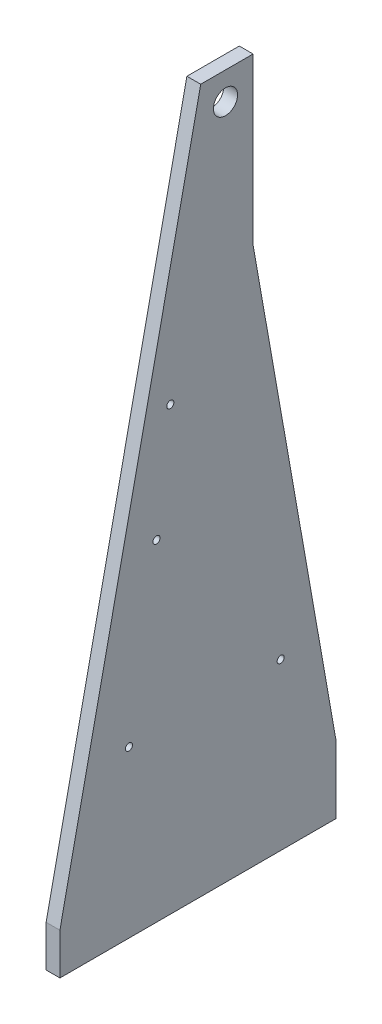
ISO-10303-21;
HEADER;
FILE_DESCRIPTION(('STEP AP214'),'2;1');
FILE_NAME('part.step','',(''),(''),'','','');
FILE_SCHEMA(('AUTOMOTIVE_DESIGN { 1 0 10303 214 1 1 1 1 }'));
ENDSEC;
DATA;
#1=APPLICATION_CONTEXT('core data for automotive mechanical design processes');
#2=APPLICATION_PROTOCOL_DEFINITION('international standard','automotive_design',2000,#1);
#3=PRODUCT_CONTEXT('',#1,'mechanical');
#4=PRODUCT('Part','Part','',(#3));
#5=PRODUCT_RELATED_PRODUCT_CATEGORY('part','',(#4));
#6=PRODUCT_DEFINITION_FORMATION('','',#4);
#7=PRODUCT_DEFINITION_CONTEXT('part definition',#1,'design');
#8=PRODUCT_DEFINITION('design','',#6,#7);
#9=PRODUCT_DEFINITION_SHAPE('','',#8);
#10=(LENGTH_UNIT() NAMED_UNIT(*) SI_UNIT(.MILLI.,.METRE.));
#11=(NAMED_UNIT(*) PLANE_ANGLE_UNIT() SI_UNIT($,.RADIAN.));
#12=(NAMED_UNIT(*) SI_UNIT($,.STERADIAN.) SOLID_ANGLE_UNIT());
#13=UNCERTAINTY_MEASURE_WITH_UNIT(LENGTH_MEASURE(1.E-05),#10,'distance_accuracy_value','');
#14=(GEOMETRIC_REPRESENTATION_CONTEXT(3) GLOBAL_UNCERTAINTY_ASSIGNED_CONTEXT((#13)) GLOBAL_UNIT_ASSIGNED_CONTEXT((#10,
#11,#12)) REPRESENTATION_CONTEXT('',''));
#15=CARTESIAN_POINT('',(0.,0.,0.));
#16=DIRECTION('',(0.,0.,1.));
#17=DIRECTION('',(1.,0.,0.));
#18=AXIS2_PLACEMENT_3D('',#15,#16,#17);
#19=CARTESIAN_POINT('',(12.7,38.1,127.));
#20=DIRECTION('',(0.,-0.20791169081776,-0.978147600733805));
#21=DIRECTION('',(0.,0.978147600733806,-0.20791169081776));
#22=AXIS2_PLACEMENT_3D('',#19,#20,#21);
#23=PLANE('',#22);
#24=DIRECTION('',(0.,-0.978147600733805,0.20791169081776));
#25=VECTOR('',#24,1.);
#26=CARTESIAN_POINT('',(0.,38.1,127.));
#27=LINE('',#26,#25);
#28=CARTESIAN_POINT('',(0.,647.7,-2.57447999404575));
#29=VERTEX_POINT('',#28);
#30=CARTESIAN_POINT('',(0.,38.1,127.));
#31=VERTEX_POINT('',#30);
#32=EDGE_CURVE('E176',#29,#31,#27,.T.);
#33=ORIENTED_EDGE('',*,*,#32,.T.);
#34=DIRECTION('',(-1.,0.,0.));
#35=VECTOR('',#34,1.);
#36=CARTESIAN_POINT('',(12.7,38.1,127.));
#37=LINE('',#36,#35);
#38=CARTESIAN_POINT('',(12.7,38.1,127.));
#39=VERTEX_POINT('',#38);
#40=EDGE_CURVE('E221',#39,#31,#37,.T.);
#41=ORIENTED_EDGE('',*,*,#40,.F.);
#42=DIRECTION('',(0.,-0.978147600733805,0.20791169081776));
#43=VECTOR('',#42,1.);
#44=CARTESIAN_POINT('',(12.7,38.1,127.));
#45=LINE('',#44,#43);
#46=CARTESIAN_POINT('',(12.7,647.7,-2.57447999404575));
#47=VERTEX_POINT('',#46);
#48=EDGE_CURVE('E177',#47,#39,#45,.T.);
#49=ORIENTED_EDGE('',*,*,#48,.F.);
#50=DIRECTION('',(-1.,0.,0.));
#51=VECTOR('',#50,1.);
#52=CARTESIAN_POINT('',(12.7,647.7,-2.57447999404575));
#53=LINE('',#52,#51);
#54=EDGE_CURVE('E193',#47,#29,#53,.T.);
#55=ORIENTED_EDGE('',*,*,#54,.T.);
#56=EDGE_LOOP('',(#33,#41,#49,#55));
#57=FACE_BOUND('',#56,.T.);
#58=ADVANCED_FACE('F37',(#57),#23,.F.);
#59=CARTESIAN_POINT('',(12.7,0.,127.));
#60=DIRECTION('',(0.,0.,-1.));
#61=DIRECTION('',(-1.,0.,0.));
#62=AXIS2_PLACEMENT_3D('',#59,#60,#61);
#63=PLANE('',#62);
#64=DIRECTION('',(0.,-1.,0.));
#65=VECTOR('',#64,1.);
#66=CARTESIAN_POINT('',(0.,0.,127.));
#67=LINE('',#66,#65);
#68=CARTESIAN_POINT('',(0.,0.,127.));
#69=VERTEX_POINT('',#68);
#70=EDGE_CURVE('E196',#31,#69,#67,.T.);
#71=ORIENTED_EDGE('',*,*,#70,.T.);
#72=DIRECTION('',(-1.,0.,0.));
#73=VECTOR('',#72,1.);
#74=CARTESIAN_POINT('',(12.7,0.,127.));
#75=LINE('',#74,#73);
#76=CARTESIAN_POINT('',(12.7,0.,127.));
#77=VERTEX_POINT('',#76);
#78=EDGE_CURVE('E218',#77,#69,#75,.T.);
#79=ORIENTED_EDGE('',*,*,#78,.F.);
#80=DIRECTION('',(0.,-1.,0.));
#81=VECTOR('',#80,1.);
#82=CARTESIAN_POINT('',(12.7,0.,127.));
#83=LINE('',#82,#81);
#84=EDGE_CURVE('E180',#39,#77,#83,.T.);
#85=ORIENTED_EDGE('',*,*,#84,.F.);
#86=ORIENTED_EDGE('',*,*,#40,.T.);
#87=EDGE_LOOP('',(#71,#79,#85,#86));
#88=FACE_BOUND('',#87,.T.);
#89=ADVANCED_FACE('F261',(#88),#63,.F.);
#90=CARTESIAN_POINT('',(12.7,0.,-127.));
#91=DIRECTION('',(0.,1.,0.));
#92=DIRECTION('',(0.,0.,1.));
#93=AXIS2_PLACEMENT_3D('',#90,#91,#92);
#94=PLANE('',#93);
#95=CARTESIAN_POINT('',(6.35,0.,-101.6));
#96=DIRECTION('',(0.,-1.,0.));
#97=DIRECTION('',(0.,0.,-1.));
#98=AXIS2_PLACEMENT_3D('',#95,#96,#97);
#99=CIRCLE('',#98,2.55269999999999);
#100=CARTESIAN_POINT('',(6.35,0.,-104.1527));
#101=VERTEX_POINT('',#100);
#102=EDGE_CURVE('E126',#101,#101,#99,.T.);
#103=ORIENTED_EDGE('',*,*,#102,.F.);
#104=EDGE_LOOP('',(#103));
#105=FACE_BOUND('',#104,.T.);
#106=CARTESIAN_POINT('',(6.34999999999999,0.,-50.8));
#107=DIRECTION('',(0.,-1.,0.));
#108=DIRECTION('',(0.,0.,-1.));
#109=AXIS2_PLACEMENT_3D('',#106,#107,#108);
#110=CIRCLE('',#109,2.55269999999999);
#111=CARTESIAN_POINT('',(6.34999999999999,0.,-53.3527));
#112=VERTEX_POINT('',#111);
#113=EDGE_CURVE('E125',#112,#112,#110,.T.);
#114=ORIENTED_EDGE('',*,*,#113,.F.);
#115=EDGE_LOOP('',(#114));
#116=FACE_BOUND('',#115,.T.);
#117=CARTESIAN_POINT('',(6.34999999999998,0.,0.));
#118=DIRECTION('',(0.,-1.,0.));
#119=DIRECTION('',(0.,0.,-1.));
#120=AXIS2_PLACEMENT_3D('',#117,#118,#119);
#121=CIRCLE('',#120,2.55269999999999);
#122=CARTESIAN_POINT('',(6.34999999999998,0.,-2.55269999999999));
#123=VERTEX_POINT('',#122);
#124=EDGE_CURVE('E136',#123,#123,#121,.T.);
#125=ORIENTED_EDGE('',*,*,#124,.F.);
#126=EDGE_LOOP('',(#125));
#127=FACE_BOUND('',#126,.T.);
#128=CARTESIAN_POINT('',(6.34999999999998,0.,50.8));
#129=DIRECTION('',(0.,-1.,0.));
#130=DIRECTION('',(0.,0.,-1.));
#131=AXIS2_PLACEMENT_3D('',#128,#129,#130);
#132=CIRCLE('',#131,2.55269999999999);
#133=CARTESIAN_POINT('',(6.34999999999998,0.,48.2473));
#134=VERTEX_POINT('',#133);
#135=EDGE_CURVE('E142',#134,#134,#132,.T.);
#136=ORIENTED_EDGE('',*,*,#135,.F.);
#137=EDGE_LOOP('',(#136));
#138=FACE_BOUND('',#137,.T.);
#139=CARTESIAN_POINT('',(6.34999999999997,0.,101.6));
#140=DIRECTION('',(0.,-1.,0.));
#141=DIRECTION('',(0.,0.,-1.));
#142=AXIS2_PLACEMENT_3D('',#139,#140,#141);
#143=CIRCLE('',#142,2.55269999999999);
#144=CARTESIAN_POINT('',(6.34999999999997,0.,99.0473));
#145=VERTEX_POINT('',#144);
#146=EDGE_CURVE('E148',#145,#145,#143,.T.);
#147=ORIENTED_EDGE('',*,*,#146,.F.);
#148=EDGE_LOOP('',(#147));
#149=FACE_BOUND('',#148,.T.);
#150=DIRECTION('',(0.,0.,-1.));
#151=VECTOR('',#150,1.);
#152=CARTESIAN_POINT('',(0.,0.,-127.));
#153=LINE('',#152,#151);
#154=CARTESIAN_POINT('',(0.,0.,-127.));
#155=VERTEX_POINT('',#154);
#156=EDGE_CURVE('E198',#69,#155,#153,.T.);
#157=ORIENTED_EDGE('',*,*,#156,.T.);
#158=DIRECTION('',(-1.,0.,0.));
#159=VECTOR('',#158,1.);
#160=CARTESIAN_POINT('',(12.7,0.,-127.));
#161=LINE('',#160,#159);
#162=CARTESIAN_POINT('',(12.7,0.,-127.));
#163=VERTEX_POINT('',#162);
#164=EDGE_CURVE('E215',#163,#155,#161,.T.);
#165=ORIENTED_EDGE('',*,*,#164,.F.);
#166=DIRECTION('',(0.,0.,-1.));
#167=VECTOR('',#166,1.);
#168=CARTESIAN_POINT('',(12.7,0.,-127.));
#169=LINE('',#168,#167);
#170=EDGE_CURVE('E183',#77,#163,#169,.T.);
#171=ORIENTED_EDGE('',*,*,#170,.F.);
#172=ORIENTED_EDGE('',*,*,#78,.T.);
#173=EDGE_LOOP('',(#157,#165,#171,#172));
#174=FACE_BOUND('',#173,.T.);
#175=ADVANCED_FACE('F265',(#105,#116,#127,#138,#149,#174),#94,.F.);
#176=CARTESIAN_POINT('',(12.7,63.1483253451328,-127.));
#177=DIRECTION('',(0.,0.,1.));
#178=DIRECTION('',(1.,0.,0.));
#179=AXIS2_PLACEMENT_3D('',#176,#177,#178);
#180=PLANE('',#179);
#181=DIRECTION('',(0.,1.,0.));
#182=VECTOR('',#181,1.);
#183=CARTESIAN_POINT('',(0.,63.1483253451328,-127.));
#184=LINE('',#183,#182);
#185=CARTESIAN_POINT('',(0.,63.1483253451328,-127.));
#186=VERTEX_POINT('',#185);
#187=EDGE_CURVE('E200',#155,#186,#184,.T.);
#188=ORIENTED_EDGE('',*,*,#187,.T.);
#189=DIRECTION('',(-1.,0.,0.));
#190=VECTOR('',#189,1.);
#191=CARTESIAN_POINT('',(12.7,63.1483253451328,-127.));
#192=LINE('',#191,#190);
#193=CARTESIAN_POINT('',(12.7,63.1483253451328,-127.));
#194=VERTEX_POINT('',#193);
#195=EDGE_CURVE('E212',#194,#186,#192,.T.);
#196=ORIENTED_EDGE('',*,*,#195,.F.);
#197=DIRECTION('',(0.,1.,0.));
#198=VECTOR('',#197,1.);
#199=CARTESIAN_POINT('',(12.7,63.1483253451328,-127.));
#200=LINE('',#199,#198);
#201=EDGE_CURVE('E185',#163,#194,#200,.T.);
#202=ORIENTED_EDGE('',*,*,#201,.F.);
#203=ORIENTED_EDGE('',*,*,#164,.T.);
#204=EDGE_LOOP('',(#188,#196,#202,#203));
#205=FACE_BOUND('',#204,.T.);
#206=ADVANCED_FACE('F271',(#205),#180,.F.);
#207=CARTESIAN_POINT('',(12.7,495.3,-50.7999999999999));
#208=DIRECTION('',(0.,-0.173648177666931,0.984807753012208));
#209=DIRECTION('',(0.,-0.984807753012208,-0.173648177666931));
#210=AXIS2_PLACEMENT_3D('',#207,#208,#209);
#211=PLANE('',#210);
#212=DIRECTION('',(0.,0.984807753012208,0.173648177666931));
#213=VECTOR('',#212,1.);
#214=CARTESIAN_POINT('',(0.,495.3,-50.7999999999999));
#215=LINE('',#214,#213);
#216=CARTESIAN_POINT('',(0.,494.468388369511,-50.9466355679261));
#217=VERTEX_POINT('',#216);
#218=EDGE_CURVE('E202',#186,#217,#215,.T.);
#219=ORIENTED_EDGE('',*,*,#218,.T.);
#220=DIRECTION('',(-1.,0.,0.));
#221=VECTOR('',#220,1.);
#222=CARTESIAN_POINT('',(12.7,494.468388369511,-50.9466355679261));
#223=LINE('',#222,#221);
#224=CARTESIAN_POINT('',(12.7,494.468388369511,-50.9466355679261));
#225=VERTEX_POINT('',#224);
#226=EDGE_CURVE('E52',#217,#225,#223,.F.);
#227=ORIENTED_EDGE('',*,*,#226,.T.);
#228=DIRECTION('',(0.,0.984807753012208,0.173648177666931));
#229=VECTOR('',#228,1.);
#230=CARTESIAN_POINT('',(12.7,495.3,-50.7999999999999));
#231=LINE('',#230,#229);
#232=EDGE_CURVE('E187',#194,#225,#231,.T.);
#233=ORIENTED_EDGE('',*,*,#232,.F.);
#234=ORIENTED_EDGE('',*,*,#195,.T.);
#235=EDGE_LOOP('',(#219,#227,#233,#234));
#236=FACE_BOUND('',#235,.T.);
#237=ADVANCED_FACE('F275',(#236),#211,.F.);
#238=CARTESIAN_POINT('',(12.7,647.7,-50.7999999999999));
#239=DIRECTION('',(0.,0.,1.));
#240=DIRECTION('',(0.,-1.,0.));
#241=AXIS2_PLACEMENT_3D('',#238,#239,#240);
#242=PLANE('',#241);
#243=DIRECTION('',(0.,1.,0.));
#244=VECTOR('',#243,1.);
#245=CARTESIAN_POINT('',(12.7,647.7,-50.7999999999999));
#246=LINE('',#245,#244);
#247=CARTESIAN_POINT('',(12.7,496.144440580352,-50.7999999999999));
#248=VERTEX_POINT('',#247);
#249=CARTESIAN_POINT('',(12.7,647.7,-50.7999999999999));
#250=VERTEX_POINT('',#249);
#251=EDGE_CURVE('E189',#248,#250,#246,.T.);
#252=ORIENTED_EDGE('',*,*,#251,.F.);
#253=DIRECTION('',(-1.,0.,0.));
#254=VECTOR('',#253,1.);
#255=CARTESIAN_POINT('',(0.,496.144440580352,-50.7999999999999));
#256=LINE('',#255,#254);
#257=CARTESIAN_POINT('',(0.,496.144440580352,-50.7999999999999));
#258=VERTEX_POINT('',#257);
#259=EDGE_CURVE('E224',#248,#258,#256,.T.);
#260=ORIENTED_EDGE('',*,*,#259,.T.);
#261=DIRECTION('',(0.,1.,0.));
#262=VECTOR('',#261,1.);
#263=CARTESIAN_POINT('',(0.,647.7,-50.7999999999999));
#264=LINE('',#263,#262);
#265=CARTESIAN_POINT('',(0.,647.7,-50.7999999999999));
#266=VERTEX_POINT('',#265);
#267=EDGE_CURVE('E204',#258,#266,#264,.T.);
#268=ORIENTED_EDGE('',*,*,#267,.T.);
#269=DIRECTION('',(-1.,0.,0.));
#270=VECTOR('',#269,1.);
#271=CARTESIAN_POINT('',(12.7,647.7,-50.7999999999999));
#272=LINE('',#271,#270);
#273=EDGE_CURVE('E209',#250,#266,#272,.T.);
#274=ORIENTED_EDGE('',*,*,#273,.F.);
#275=EDGE_LOOP('',(#252,#260,#268,#274));
#276=FACE_BOUND('',#275,.T.);
#277=ADVANCED_FACE('F238',(#276),#242,.F.);
#278=CARTESIAN_POINT('',(12.7,647.7,-2.57447999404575));
#279=DIRECTION('',(0.,-1.,0.));
#280=DIRECTION('',(0.,0.,-1.));
#281=AXIS2_PLACEMENT_3D('',#278,#279,#280);
#282=PLANE('',#281);
#283=DIRECTION('',(0.,0.,1.));
#284=VECTOR('',#283,1.);
#285=CARTESIAN_POINT('',(0.,647.7,-2.57447999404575));
#286=LINE('',#285,#284);
#287=EDGE_CURVE('E181',#266,#29,#286,.T.);
#288=ORIENTED_EDGE('',*,*,#287,.T.);
#289=ORIENTED_EDGE('',*,*,#54,.F.);
#290=DIRECTION('',(0.,0.,1.));
#291=VECTOR('',#290,1.);
#292=CARTESIAN_POINT('',(12.7,647.7,-2.57447999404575));
#293=LINE('',#292,#291);
#294=EDGE_CURVE('E191',#250,#47,#293,.T.);
#295=ORIENTED_EDGE('',*,*,#294,.F.);
#296=ORIENTED_EDGE('',*,*,#273,.T.);
#297=EDGE_LOOP('',(#288,#289,#295,#296));
#298=FACE_BOUND('',#297,.T.);
#299=ADVANCED_FACE('F247',(#298),#282,.F.);
#300=CARTESIAN_POINT('',(12.7,0.,0.));
#301=DIRECTION('',(-1.,0.,0.));
#302=DIRECTION('',(0.,0.,1.));
#303=AXIS2_PLACEMENT_3D('',#300,#301,#302);
#304=PLANE('',#303);
#305=CARTESIAN_POINT('',(12.7,406.4,25.4));
#306=DIRECTION('',(1.,0.,0.));
#307=DIRECTION('',(0.,0.,-1.));
#308=AXIS2_PLACEMENT_3D('',#305,#306,#307);
#309=CIRCLE('',#308,3.26389999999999);
#310=CARTESIAN_POINT('',(12.7,406.4,22.1361));
#311=VERTEX_POINT('',#310);
#312=EDGE_CURVE('E154',#311,#311,#309,.T.);
#313=ORIENTED_EDGE('',*,*,#312,.F.);
#314=EDGE_LOOP('',(#313));
#315=FACE_BOUND('',#314,.T.);
#316=CARTESIAN_POINT('',(12.7,304.8,38.1));
#317=DIRECTION('',(1.,0.,0.));
#318=DIRECTION('',(0.,0.,-1.));
#319=AXIS2_PLACEMENT_3D('',#316,#317,#318);
#320=CIRCLE('',#319,3.26389999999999);
#321=CARTESIAN_POINT('',(12.7,304.8,34.8361));
#322=VERTEX_POINT('',#321);
#323=EDGE_CURVE('E158',#322,#322,#320,.T.);
#324=ORIENTED_EDGE('',*,*,#323,.F.);
#325=EDGE_LOOP('',(#324));
#326=FACE_BOUND('',#325,.T.);
#327=CARTESIAN_POINT('',(12.7,152.4,63.5));
#328=DIRECTION('',(1.,0.,0.));
#329=DIRECTION('',(0.,0.,-1.));
#330=AXIS2_PLACEMENT_3D('',#327,#328,#329);
#331=CIRCLE('',#330,3.26389999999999);
#332=CARTESIAN_POINT('',(12.7,152.4,60.2361));
#333=VERTEX_POINT('',#332);
#334=EDGE_CURVE('E162',#333,#333,#331,.T.);
#335=ORIENTED_EDGE('',*,*,#334,.F.);
#336=EDGE_LOOP('',(#335));
#337=FACE_BOUND('',#336,.T.);
#338=CARTESIAN_POINT('',(12.7,152.4,-76.2));
#339=DIRECTION('',(1.,0.,0.));
#340=DIRECTION('',(0.,0.,-1.));
#341=AXIS2_PLACEMENT_3D('',#338,#339,#340);
#342=CIRCLE('',#341,3.26389999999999);
#343=CARTESIAN_POINT('',(12.7,152.4,-79.4639));
#344=VERTEX_POINT('',#343);
#345=EDGE_CURVE('E166',#344,#344,#342,.T.);
#346=ORIENTED_EDGE('',*,*,#345,.F.);
#347=EDGE_LOOP('',(#346));
#348=FACE_BOUND('',#347,.T.);
#349=CARTESIAN_POINT('',(12.7,622.3,-25.3999999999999));
#350=DIRECTION('',(1.,0.,0.));
#351=DIRECTION('',(0.,0.,-1.));
#352=AXIS2_PLACEMENT_3D('',#349,#350,#351);
#353=CIRCLE('',#352,11.1125);
#354=CARTESIAN_POINT('',(12.7,622.3,-36.5124999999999));
#355=VERTEX_POINT('',#354);
#356=EDGE_CURVE('E170',#355,#355,#353,.T.);
#357=ORIENTED_EDGE('',*,*,#356,.F.);
#358=EDGE_LOOP('',(#357));
#359=FACE_BOUND('',#358,.T.);
#360=ORIENTED_EDGE('',*,*,#48,.T.);
#361=ORIENTED_EDGE('',*,*,#84,.T.);
#362=ORIENTED_EDGE('',*,*,#170,.T.);
#363=ORIENTED_EDGE('',*,*,#201,.T.);
#364=ORIENTED_EDGE('',*,*,#232,.T.);
#365=CARTESIAN_POINT('',(12.7,496.144440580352,-60.4519999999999));
#366=DIRECTION('',(-1.,0.,0.));
#367=DIRECTION('',(0.,0.,1.));
#368=AXIS2_PLACEMENT_3D('',#365,#366,#367);
#369=CIRCLE('',#368,9.652);
#370=EDGE_CURVE('E11',#225,#248,#369,.T.);
#371=ORIENTED_EDGE('',*,*,#370,.T.);
#372=ORIENTED_EDGE('',*,*,#251,.T.);
#373=ORIENTED_EDGE('',*,*,#294,.T.);
#374=EDGE_LOOP('',(#360,#361,#362,#363,#364,#371,#372,#373));
#375=FACE_BOUND('',#374,.T.);
#376=ADVANCED_FACE('F253',(#315,#326,#337,#348,#359,#375),#304,.F.);
#377=CARTESIAN_POINT('',(0.,0.,0.));
#378=DIRECTION('',(-1.,0.,0.));
#379=DIRECTION('',(0.,0.,1.));
#380=AXIS2_PLACEMENT_3D('',#377,#378,#379);
#381=PLANE('',#380);
#382=CARTESIAN_POINT('',(0.,406.4,25.4));
#383=DIRECTION('',(-1.,0.,0.));
#384=DIRECTION('',(0.,0.,1.));
#385=AXIS2_PLACEMENT_3D('',#382,#383,#384);
#386=CIRCLE('',#385,3.26389999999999);
#387=CARTESIAN_POINT('',(0.,406.4,28.6639));
#388=VERTEX_POINT('',#387);
#389=EDGE_CURVE('E157',#388,#388,#386,.T.);
#390=ORIENTED_EDGE('',*,*,#389,.F.);
#391=EDGE_LOOP('',(#390));
#392=FACE_BOUND('',#391,.T.);
#393=CARTESIAN_POINT('',(0.,304.8,38.1));
#394=DIRECTION('',(-1.,0.,0.));
#395=DIRECTION('',(0.,0.,1.));
#396=AXIS2_PLACEMENT_3D('',#393,#394,#395);
#397=CIRCLE('',#396,3.26389999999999);
#398=CARTESIAN_POINT('',(0.,304.8,41.3639));
#399=VERTEX_POINT('',#398);
#400=EDGE_CURVE('E161',#399,#399,#397,.T.);
#401=ORIENTED_EDGE('',*,*,#400,.F.);
#402=EDGE_LOOP('',(#401));
#403=FACE_BOUND('',#402,.T.);
#404=CARTESIAN_POINT('',(0.,152.4,63.5));
#405=DIRECTION('',(-1.,0.,0.));
#406=DIRECTION('',(0.,0.,1.));
#407=AXIS2_PLACEMENT_3D('',#404,#405,#406);
#408=CIRCLE('',#407,3.26389999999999);
#409=CARTESIAN_POINT('',(0.,152.4,66.7639));
#410=VERTEX_POINT('',#409);
#411=EDGE_CURVE('E165',#410,#410,#408,.T.);
#412=ORIENTED_EDGE('',*,*,#411,.F.);
#413=EDGE_LOOP('',(#412));
#414=FACE_BOUND('',#413,.T.);
#415=CARTESIAN_POINT('',(0.,152.4,-76.2));
#416=DIRECTION('',(-1.,0.,0.));
#417=DIRECTION('',(0.,0.,1.));
#418=AXIS2_PLACEMENT_3D('',#415,#416,#417);
#419=CIRCLE('',#418,3.26389999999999);
#420=CARTESIAN_POINT('',(0.,152.4,-72.9361));
#421=VERTEX_POINT('',#420);
#422=EDGE_CURVE('E169',#421,#421,#419,.T.);
#423=ORIENTED_EDGE('',*,*,#422,.F.);
#424=EDGE_LOOP('',(#423));
#425=FACE_BOUND('',#424,.T.);
#426=CARTESIAN_POINT('',(0.,622.3,-25.3999999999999));
#427=DIRECTION('',(1.,0.,0.));
#428=DIRECTION('',(0.,0.,-1.));
#429=AXIS2_PLACEMENT_3D('',#426,#427,#428);
#430=CIRCLE('',#429,11.1125);
#431=CARTESIAN_POINT('',(0.,622.3,-36.5124999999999));
#432=VERTEX_POINT('',#431);
#433=EDGE_CURVE('E173',#432,#432,#430,.T.);
#434=ORIENTED_EDGE('',*,*,#433,.T.);
#435=EDGE_LOOP('',(#434));
#436=FACE_BOUND('',#435,.T.);
#437=ORIENTED_EDGE('',*,*,#32,.F.);
#438=ORIENTED_EDGE('',*,*,#287,.F.);
#439=ORIENTED_EDGE('',*,*,#267,.F.);
#440=CARTESIAN_POINT('',(0.,496.144440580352,-60.4519999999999));
#441=DIRECTION('',(-1.,0.,0.));
#442=DIRECTION('',(0.,0.,1.));
#443=AXIS2_PLACEMENT_3D('',#440,#441,#442);
#444=CIRCLE('',#443,9.652);
#445=EDGE_CURVE('E45',#258,#217,#444,.F.);
#446=ORIENTED_EDGE('',*,*,#445,.T.);
#447=ORIENTED_EDGE('',*,*,#218,.F.);
#448=ORIENTED_EDGE('',*,*,#187,.F.);
#449=ORIENTED_EDGE('',*,*,#156,.F.);
#450=ORIENTED_EDGE('',*,*,#70,.F.);
#451=EDGE_LOOP('',(#437,#438,#439,#446,#447,#448,#449,#450));
#452=FACE_BOUND('',#451,.T.);
#453=ADVANCED_FACE('F244',(#392,#403,#414,#425,#436,#452),#381,.T.);
#454=CARTESIAN_POINT('',(12.7,622.3,-25.3999999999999));
#455=DIRECTION('',(1.,0.,0.));
#456=DIRECTION('',(0.,0.,-1.));
#457=AXIS2_PLACEMENT_3D('',#454,#455,#456);
#458=CYLINDRICAL_SURFACE('',#457,11.1125);
#459=ORIENTED_EDGE('',*,*,#433,.F.);
#460=EDGE_LOOP('',(#459));
#461=FACE_BOUND('',#460,.T.);
#462=ORIENTED_EDGE('',*,*,#356,.T.);
#463=EDGE_LOOP('',(#462));
#464=FACE_BOUND('',#463,.T.);
#465=ADVANCED_FACE('F285',(#461,#464),#458,.F.);
#466=CARTESIAN_POINT('',(12.7,152.4,-76.2));
#467=DIRECTION('',(1.,0.,0.));
#468=DIRECTION('',(0.,0.,-1.));
#469=AXIS2_PLACEMENT_3D('',#466,#467,#468);
#470=CYLINDRICAL_SURFACE('',#469,3.26389999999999);
#471=ORIENTED_EDGE('',*,*,#422,.T.);
#472=EDGE_LOOP('',(#471));
#473=FACE_BOUND('',#472,.T.);
#474=ORIENTED_EDGE('',*,*,#345,.T.);
#475=EDGE_LOOP('',(#474));
#476=FACE_BOUND('',#475,.T.);
#477=ADVANCED_FACE('F292',(#473,#476),#470,.F.);
#478=CARTESIAN_POINT('',(12.7,152.4,63.5));
#479=DIRECTION('',(1.,0.,0.));
#480=DIRECTION('',(0.,0.,-1.));
#481=AXIS2_PLACEMENT_3D('',#478,#479,#480);
#482=CYLINDRICAL_SURFACE('',#481,3.26389999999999);
#483=ORIENTED_EDGE('',*,*,#411,.T.);
#484=EDGE_LOOP('',(#483));
#485=FACE_BOUND('',#484,.T.);
#486=ORIENTED_EDGE('',*,*,#334,.T.);
#487=EDGE_LOOP('',(#486));
#488=FACE_BOUND('',#487,.T.);
#489=ADVANCED_FACE('F296',(#485,#488),#482,.F.);
#490=CARTESIAN_POINT('',(12.7,304.8,38.1));
#491=DIRECTION('',(1.,0.,0.));
#492=DIRECTION('',(0.,0.,-1.));
#493=AXIS2_PLACEMENT_3D('',#490,#491,#492);
#494=CYLINDRICAL_SURFACE('',#493,3.26389999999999);
#495=ORIENTED_EDGE('',*,*,#400,.T.);
#496=EDGE_LOOP('',(#495));
#497=FACE_BOUND('',#496,.T.);
#498=ORIENTED_EDGE('',*,*,#323,.T.);
#499=EDGE_LOOP('',(#498));
#500=FACE_BOUND('',#499,.T.);
#501=ADVANCED_FACE('F300',(#497,#500),#494,.F.);
#502=CARTESIAN_POINT('',(12.7,406.4,25.4));
#503=DIRECTION('',(1.,0.,0.));
#504=DIRECTION('',(0.,0.,-1.));
#505=AXIS2_PLACEMENT_3D('',#502,#503,#504);
#506=CYLINDRICAL_SURFACE('',#505,3.26389999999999);
#507=ORIENTED_EDGE('',*,*,#389,.T.);
#508=EDGE_LOOP('',(#507));
#509=FACE_BOUND('',#508,.T.);
#510=ORIENTED_EDGE('',*,*,#312,.T.);
#511=EDGE_LOOP('',(#510));
#512=FACE_BOUND('',#511,.T.);
#513=ADVANCED_FACE('F304',(#509,#512),#506,.F.);
#514=CARTESIAN_POINT('',(6.34999999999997,13.335,101.6));
#515=DIRECTION('',(0.,-1.,0.));
#516=DIRECTION('',(0.,0.,-1.));
#517=AXIS2_PLACEMENT_3D('',#514,#515,#516);
#518=CONICAL_SURFACE('',#517,2.55269999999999,1.02974425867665);
#519=CARTESIAN_POINT('',(6.34999999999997,14.8688169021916,101.6));
#520=VERTEX_POINT('',#519);
#521=VERTEX_LOOP('',#520);
#522=FACE_BOUND('',#521,.T.);
#523=CARTESIAN_POINT('',(6.34999999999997,13.335,101.6));
#524=DIRECTION('',(0.,-1.,0.));
#525=DIRECTION('',(0.,0.,-1.));
#526=AXIS2_PLACEMENT_3D('',#523,#524,#525);
#527=CIRCLE('',#526,2.55269999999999);
#528=CARTESIAN_POINT('',(6.34999999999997,13.335,99.0473));
#529=VERTEX_POINT('',#528);
#530=EDGE_CURVE('E151',#529,#529,#527,.T.);
#531=ORIENTED_EDGE('',*,*,#530,.T.);
#532=EDGE_LOOP('',(#531));
#533=FACE_BOUND('',#532,.T.);
#534=ADVANCED_FACE('F308',(#522,#533),#518,.F.);
#535=CARTESIAN_POINT('',(6.34999999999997,0.,101.6));
#536=DIRECTION('',(0.,-1.,0.));
#537=DIRECTION('',(0.,0.,-1.));
#538=AXIS2_PLACEMENT_3D('',#535,#536,#537);
#539=CYLINDRICAL_SURFACE('',#538,2.55269999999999);
#540=ORIENTED_EDGE('',*,*,#530,.F.);
#541=EDGE_LOOP('',(#540));
#542=FACE_BOUND('',#541,.T.);
#543=ORIENTED_EDGE('',*,*,#146,.T.);
#544=EDGE_LOOP('',(#543));
#545=FACE_BOUND('',#544,.T.);
#546=ADVANCED_FACE('F312',(#542,#545),#539,.F.);
#547=CARTESIAN_POINT('',(6.34999999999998,13.335,50.8));
#548=DIRECTION('',(0.,-1.,0.));
#549=DIRECTION('',(0.,0.,-1.));
#550=AXIS2_PLACEMENT_3D('',#547,#548,#549);
#551=CONICAL_SURFACE('',#550,2.55269999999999,1.02974425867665);
#552=CARTESIAN_POINT('',(6.34999999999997,14.8688169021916,50.8));
#553=VERTEX_POINT('',#552);
#554=VERTEX_LOOP('',#553);
#555=FACE_BOUND('',#554,.T.);
#556=CARTESIAN_POINT('',(6.34999999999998,13.335,50.8));
#557=DIRECTION('',(0.,-1.,0.));
#558=DIRECTION('',(0.,0.,-1.));
#559=AXIS2_PLACEMENT_3D('',#556,#557,#558);
#560=CIRCLE('',#559,2.55269999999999);
#561=CARTESIAN_POINT('',(6.34999999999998,13.335,48.2473));
#562=VERTEX_POINT('',#561);
#563=EDGE_CURVE('E145',#562,#562,#560,.T.);
#564=ORIENTED_EDGE('',*,*,#563,.T.);
#565=EDGE_LOOP('',(#564));
#566=FACE_BOUND('',#565,.T.);
#567=ADVANCED_FACE('F316',(#555,#566),#551,.F.);
#568=CARTESIAN_POINT('',(6.34999999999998,0.,50.8));
#569=DIRECTION('',(0.,-1.,0.));
#570=DIRECTION('',(0.,0.,-1.));
#571=AXIS2_PLACEMENT_3D('',#568,#569,#570);
#572=CYLINDRICAL_SURFACE('',#571,2.55269999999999);
#573=ORIENTED_EDGE('',*,*,#563,.F.);
#574=EDGE_LOOP('',(#573));
#575=FACE_BOUND('',#574,.T.);
#576=ORIENTED_EDGE('',*,*,#135,.T.);
#577=EDGE_LOOP('',(#576));
#578=FACE_BOUND('',#577,.T.);
#579=ADVANCED_FACE('F320',(#575,#578),#572,.F.);
#580=CARTESIAN_POINT('',(6.34999999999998,13.335,0.));
#581=DIRECTION('',(0.,-1.,0.));
#582=DIRECTION('',(0.,0.,-1.));
#583=AXIS2_PLACEMENT_3D('',#580,#581,#582);
#584=CONICAL_SURFACE('',#583,2.55269999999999,1.02974425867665);
#585=CARTESIAN_POINT('',(6.34999999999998,14.8688169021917,0.));
#586=VERTEX_POINT('',#585);
#587=VERTEX_LOOP('',#586);
#588=FACE_BOUND('',#587,.T.);
#589=CARTESIAN_POINT('',(6.34999999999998,13.335,0.));
#590=DIRECTION('',(0.,-1.,0.));
#591=DIRECTION('',(0.,0.,-1.));
#592=AXIS2_PLACEMENT_3D('',#589,#590,#591);
#593=CIRCLE('',#592,2.55269999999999);
#594=CARTESIAN_POINT('',(6.34999999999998,13.335,-2.55269999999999));
#595=VERTEX_POINT('',#594);
#596=EDGE_CURVE('E139',#595,#595,#593,.T.);
#597=ORIENTED_EDGE('',*,*,#596,.T.);
#598=EDGE_LOOP('',(#597));
#599=FACE_BOUND('',#598,.T.);
#600=ADVANCED_FACE('F324',(#588,#599),#584,.F.);
#601=CARTESIAN_POINT('',(6.34999999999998,0.,0.));
#602=DIRECTION('',(0.,-1.,0.));
#603=DIRECTION('',(0.,0.,-1.));
#604=AXIS2_PLACEMENT_3D('',#601,#602,#603);
#605=CYLINDRICAL_SURFACE('',#604,2.55269999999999);
#606=ORIENTED_EDGE('',*,*,#596,.F.);
#607=EDGE_LOOP('',(#606));
#608=FACE_BOUND('',#607,.T.);
#609=ORIENTED_EDGE('',*,*,#124,.T.);
#610=EDGE_LOOP('',(#609));
#611=FACE_BOUND('',#610,.T.);
#612=ADVANCED_FACE('F328',(#608,#611),#605,.F.);
#613=CARTESIAN_POINT('',(6.34999999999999,13.335,-50.8));
#614=DIRECTION('',(0.,-1.,0.));
#615=DIRECTION('',(0.,0.,-1.));
#616=AXIS2_PLACEMENT_3D('',#613,#614,#615);
#617=CONICAL_SURFACE('',#616,2.55269999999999,1.02974425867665);
#618=CARTESIAN_POINT('',(6.34999999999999,14.8688169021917,-50.8));
#619=VERTEX_POINT('',#618);
#620=VERTEX_LOOP('',#619);
#621=FACE_BOUND('',#620,.T.);
#622=CARTESIAN_POINT('',(6.34999999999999,13.335,-50.8));
#623=DIRECTION('',(0.,-1.,0.));
#624=DIRECTION('',(0.,0.,-1.));
#625=AXIS2_PLACEMENT_3D('',#622,#623,#624);
#626=CIRCLE('',#625,2.55269999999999);
#627=CARTESIAN_POINT('',(6.34999999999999,13.335,-53.3527));
#628=VERTEX_POINT('',#627);
#629=EDGE_CURVE('E129',#628,#628,#626,.T.);
#630=ORIENTED_EDGE('',*,*,#629,.T.);
#631=EDGE_LOOP('',(#630));
#632=FACE_BOUND('',#631,.T.);
#633=ADVANCED_FACE('F332',(#621,#632),#617,.F.);
#634=CARTESIAN_POINT('',(6.34999999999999,0.,-50.8));
#635=DIRECTION('',(0.,-1.,0.));
#636=DIRECTION('',(0.,0.,-1.));
#637=AXIS2_PLACEMENT_3D('',#634,#635,#636);
#638=CYLINDRICAL_SURFACE('',#637,2.55269999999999);
#639=ORIENTED_EDGE('',*,*,#629,.F.);
#640=EDGE_LOOP('',(#639));
#641=FACE_BOUND('',#640,.T.);
#642=ORIENTED_EDGE('',*,*,#113,.T.);
#643=EDGE_LOOP('',(#642));
#644=FACE_BOUND('',#643,.T.);
#645=ADVANCED_FACE('F119',(#641,#644),#638,.F.);
#646=CARTESIAN_POINT('',(6.35,13.335,-101.6));
#647=DIRECTION('',(0.,-1.,0.));
#648=DIRECTION('',(0.,0.,-1.));
#649=AXIS2_PLACEMENT_3D('',#646,#647,#648);
#650=CONICAL_SURFACE('',#649,2.55269999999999,1.02974425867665);
#651=CARTESIAN_POINT('',(6.34999999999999,14.8688169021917,-101.6));
#652=VERTEX_POINT('',#651);
#653=VERTEX_LOOP('',#652);
#654=FACE_BOUND('',#653,.T.);
#655=CARTESIAN_POINT('',(6.35,13.335,-101.6));
#656=DIRECTION('',(0.,-1.,0.));
#657=DIRECTION('',(0.,0.,-1.));
#658=AXIS2_PLACEMENT_3D('',#655,#656,#657);
#659=CIRCLE('',#658,2.55269999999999);
#660=CARTESIAN_POINT('',(6.35,13.335,-104.1527));
#661=VERTEX_POINT('',#660);
#662=EDGE_CURVE('E123',#661,#661,#659,.T.);
#663=ORIENTED_EDGE('',*,*,#662,.T.);
#664=EDGE_LOOP('',(#663));
#665=FACE_BOUND('',#664,.T.);
#666=ADVANCED_FACE('F115',(#654,#665),#650,.F.);
#667=CARTESIAN_POINT('',(6.35,0.,-101.6));
#668=DIRECTION('',(0.,-1.,0.));
#669=DIRECTION('',(0.,0.,-1.));
#670=AXIS2_PLACEMENT_3D('',#667,#668,#669);
#671=CYLINDRICAL_SURFACE('',#670,2.55269999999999);
#672=ORIENTED_EDGE('',*,*,#662,.F.);
#673=EDGE_LOOP('',(#672));
#674=FACE_BOUND('',#673,.T.);
#675=ORIENTED_EDGE('',*,*,#102,.T.);
#676=EDGE_LOOP('',(#675));
#677=FACE_BOUND('',#676,.T.);
#678=ADVANCED_FACE('F118',(#674,#677),#671,.F.);
#679=CARTESIAN_POINT('',(12.7,496.144440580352,-60.4519999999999));
#680=DIRECTION('',(1.,0.,0.));
#681=DIRECTION('',(0.,0.,-1.));
#682=AXIS2_PLACEMENT_3D('',#679,#680,#681);
#683=CYLINDRICAL_SURFACE('',#682,9.652);
#684=ORIENTED_EDGE('',*,*,#370,.F.);
#685=ORIENTED_EDGE('',*,*,#226,.F.);
#686=ORIENTED_EDGE('',*,*,#445,.F.);
#687=ORIENTED_EDGE('',*,*,#259,.F.);
#688=EDGE_LOOP('',(#684,#685,#686,#687));
#689=FACE_BOUND('',#688,.T.);
#690=ADVANCED_FACE('F39',(#689),#683,.F.);
#691=CLOSED_SHELL('',(#58,#89,#175,#206,#237,#277,#299,#376,#453,#465,#477,#489,#501,#513,#534,
#546,#567,#579,#600,#612,#633,#645,#666,#678,#690));
#692=MANIFOLD_SOLID_BREP('B2',#691);
#693=ADVANCED_BREP_SHAPE_REPRESENTATION('',(#18,#692),#14);
#694=SHAPE_DEFINITION_REPRESENTATION(#9,#693);
ENDSEC;
END-ISO-10303-21;
